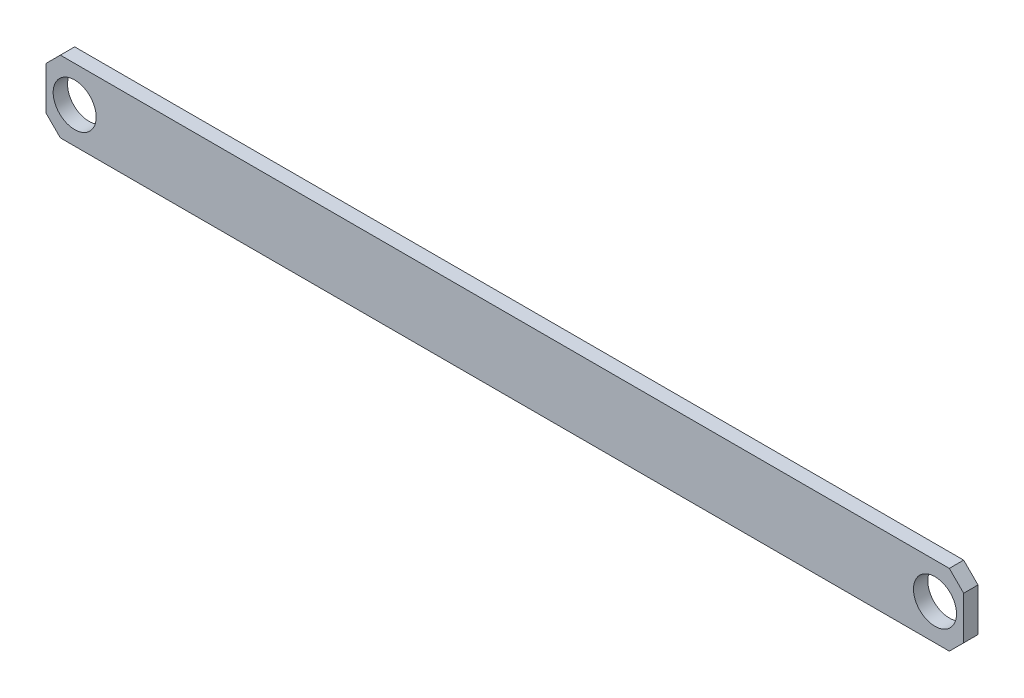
from build123d import *

# Parameters (mm, degrees)
SKETCH1_W          = 203.2
SKETCH1_H          = 15.875
BASE_EXTRUDE_DEPTH = 3.175
SKETCH2_R          = 4.7625
CUT_EXTRUDE1_DEPTH = 204.843901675
SKETCH3_R          = 4.7625
CUT_EXTRUDE2_DEPTH = 186.995222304
CHAMFER1_SIZE      = 3.175
CHAMFER2_SIZE      = 3.175


with BuildPart() as part:
    # Sketch1 → Base-Extrude (new body)
    with BuildSketch(Plane.XY):
        with Locations((101.6, 7.9375)):
            Rectangle(SKETCH1_W, SKETCH1_H)
    extrude(amount=BASE_EXTRUDE_DEPTH)

    # Sketch2 → Cut-Extrude1 (cut, through all)
    with BuildSketch(Plane.XY.offset(3.175)):
        with Locations((6.35, 7.9375)):
            Circle(SKETCH2_R)
    extrude(amount=-CUT_EXTRUDE1_DEPTH, mode=Mode.SUBTRACT)

    # Sketch3 → Cut-Extrude2 (cut, through all)
    with BuildSketch(Plane(origin=(185.269572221, -0.228654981, 3.175), x_dir=(1, 0, 0), z_dir=(0, 0, 1))):
        with Locations((11.580427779, 8.166154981)):
            Circle(SKETCH3_R)
    extrude(amount=-CUT_EXTRUDE2_DEPTH, mode=Mode.SUBTRACT)

    # Chamfer1
    chamfer1_edges = [part.edges().sort_by_distance(p)[0] for p in [
        (0, 0, 1.5875),
        (0, 15.875, 1.5875),
    ]]
    chamfer(chamfer1_edges, length=CHAMFER1_SIZE)

    # Chamfer2
    chamfer2_edges = [part.edges().sort_by_distance(p)[0] for p in [
        (203.2, 0, 1.5875),
        (203.2, 15.875, 1.5875),
    ]]
    chamfer(chamfer2_edges, length=CHAMFER2_SIZE)


solid = part.part
